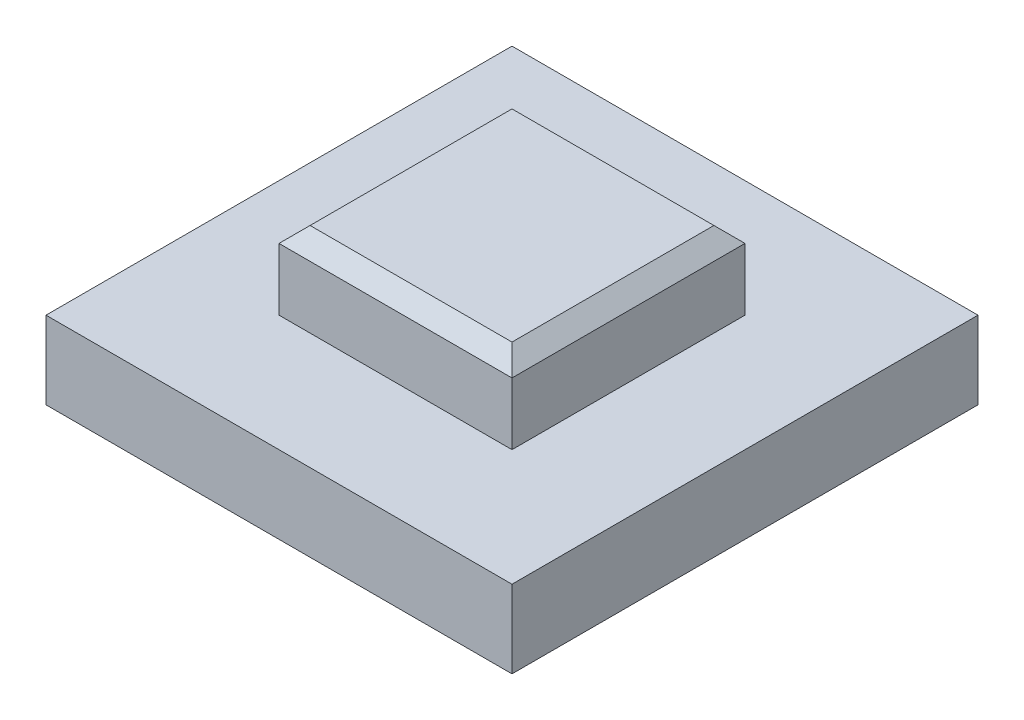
ISO-10303-21;
HEADER;
FILE_DESCRIPTION(('STEP AP214'),'2;1');
FILE_NAME('part.step','',(''),(''),'','','');
FILE_SCHEMA(('AUTOMOTIVE_DESIGN { 1 0 10303 214 1 1 1 1 }'));
ENDSEC;
DATA;
#1=APPLICATION_CONTEXT('core data for automotive mechanical design processes');
#2=APPLICATION_PROTOCOL_DEFINITION('international standard','automotive_design',2000,#1);
#3=PRODUCT_CONTEXT('',#1,'mechanical');
#4=PRODUCT('Part','Part','',(#3));
#5=PRODUCT_RELATED_PRODUCT_CATEGORY('part','',(#4));
#6=PRODUCT_DEFINITION_FORMATION('','',#4);
#7=PRODUCT_DEFINITION_CONTEXT('part definition',#1,'design');
#8=PRODUCT_DEFINITION('design','',#6,#7);
#9=PRODUCT_DEFINITION_SHAPE('','',#8);
#10=(LENGTH_UNIT() NAMED_UNIT(*) SI_UNIT(.MILLI.,.METRE.));
#11=(NAMED_UNIT(*) PLANE_ANGLE_UNIT() SI_UNIT($,.RADIAN.));
#12=(NAMED_UNIT(*) SI_UNIT($,.STERADIAN.) SOLID_ANGLE_UNIT());
#13=UNCERTAINTY_MEASURE_WITH_UNIT(LENGTH_MEASURE(1.E-05),#10,'distance_accuracy_value','');
#14=(GEOMETRIC_REPRESENTATION_CONTEXT(3) GLOBAL_UNCERTAINTY_ASSIGNED_CONTEXT((#13)) GLOBAL_UNIT_ASSIGNED_CONTEXT((#10,
#11,#12)) REPRESENTATION_CONTEXT('',''));
#15=CARTESIAN_POINT('',(0.,0.,0.));
#16=DIRECTION('',(0.,0.,1.));
#17=DIRECTION('',(1.,0.,0.));
#18=AXIS2_PLACEMENT_3D('',#15,#16,#17);
#19=CARTESIAN_POINT('',(-38.1,12.7,38.1));
#20=DIRECTION('',(0.,1.,0.));
#21=DIRECTION('',(0.,0.,1.));
#22=AXIS2_PLACEMENT_3D('',#19,#20,#21);
#23=PLANE('',#22);
#24=DIRECTION('',(0.,0.,1.));
#25=VECTOR('',#24,1.);
#26=CARTESIAN_POINT('',(-38.1,12.7,-38.1));
#27=LINE('',#26,#25);
#28=CARTESIAN_POINT('',(-38.1,12.7,-38.1));
#29=VERTEX_POINT('',#28);
#30=CARTESIAN_POINT('',(-38.1,12.7,38.1));
#31=VERTEX_POINT('',#30);
#32=EDGE_CURVE('E146',#29,#31,#27,.T.);
#33=ORIENTED_EDGE('',*,*,#32,.T.);
#34=DIRECTION('',(1.,0.,0.));
#35=VECTOR('',#34,1.);
#36=CARTESIAN_POINT('',(-38.1,12.7,38.1));
#37=LINE('',#36,#35);
#38=CARTESIAN_POINT('',(38.1,12.7,38.1));
#39=VERTEX_POINT('',#38);
#40=EDGE_CURVE('E149',#31,#39,#37,.T.);
#41=ORIENTED_EDGE('',*,*,#40,.T.);
#42=DIRECTION('',(0.,0.,-1.));
#43=VECTOR('',#42,1.);
#44=CARTESIAN_POINT('',(38.1,12.7,-38.1));
#45=LINE('',#44,#43);
#46=CARTESIAN_POINT('',(38.1,12.7,-38.1));
#47=VERTEX_POINT('',#46);
#48=EDGE_CURVE('E151',#39,#47,#45,.T.);
#49=ORIENTED_EDGE('',*,*,#48,.T.);
#50=DIRECTION('',(-1.,0.,0.));
#51=VECTOR('',#50,1.);
#52=CARTESIAN_POINT('',(-38.1,12.7,-38.1));
#53=LINE('',#52,#51);
#54=EDGE_CURVE('E153',#47,#29,#53,.T.);
#55=ORIENTED_EDGE('',*,*,#54,.T.);
#56=EDGE_LOOP('',(#33,#41,#49,#55));
#57=FACE_BOUND('',#56,.T.);
#58=DIRECTION('',(-1.,0.,0.));
#59=VECTOR('',#58,1.);
#60=CARTESIAN_POINT('',(19.05,12.7,-19.05));
#61=LINE('',#60,#59);
#62=CARTESIAN_POINT('',(19.05,12.7,-19.05));
#63=VERTEX_POINT('',#62);
#64=CARTESIAN_POINT('',(-19.05,12.7,-19.05));
#65=VERTEX_POINT('',#64);
#66=EDGE_CURVE('E109',#63,#65,#61,.T.);
#67=ORIENTED_EDGE('',*,*,#66,.F.);
#68=DIRECTION('',(0.,0.,-1.));
#69=VECTOR('',#68,1.);
#70=CARTESIAN_POINT('',(19.05,12.7,-19.05));
#71=LINE('',#70,#69);
#72=CARTESIAN_POINT('',(19.05,12.7,19.05));
#73=VERTEX_POINT('',#72);
#74=EDGE_CURVE('E117',#73,#63,#71,.T.);
#75=ORIENTED_EDGE('',*,*,#74,.F.);
#76=DIRECTION('',(1.,0.,0.));
#77=VECTOR('',#76,1.);
#78=CARTESIAN_POINT('',(19.05,12.7,19.05));
#79=LINE('',#78,#77);
#80=CARTESIAN_POINT('',(-19.05,12.7,19.05));
#81=VERTEX_POINT('',#80);
#82=EDGE_CURVE('E129',#81,#73,#79,.T.);
#83=ORIENTED_EDGE('',*,*,#82,.F.);
#84=DIRECTION('',(0.,0.,1.));
#85=VECTOR('',#84,1.);
#86=CARTESIAN_POINT('',(-19.05,12.7,-19.05));
#87=LINE('',#86,#85);
#88=EDGE_CURVE('E127',#65,#81,#87,.T.);
#89=ORIENTED_EDGE('',*,*,#88,.F.);
#90=EDGE_LOOP('',(#67,#75,#83,#89));
#91=FACE_BOUND('',#90,.T.);
#92=ADVANCED_FACE('F31',(#57,#91),#23,.T.);
#93=CARTESIAN_POINT('',(-38.1,12.7,-38.1));
#94=DIRECTION('',(1.,0.,0.));
#95=DIRECTION('',(0.,0.,-1.));
#96=AXIS2_PLACEMENT_3D('',#93,#94,#95);
#97=PLANE('',#96);
#98=DIRECTION('',(0.,0.,1.));
#99=VECTOR('',#98,1.);
#100=CARTESIAN_POINT('',(-38.1,0.,-38.1));
#101=LINE('',#100,#99);
#102=CARTESIAN_POINT('',(-38.1,0.,-38.1));
#103=VERTEX_POINT('',#102);
#104=CARTESIAN_POINT('',(-38.1,0.,38.1));
#105=VERTEX_POINT('',#104);
#106=EDGE_CURVE('E113',#103,#105,#101,.T.);
#107=ORIENTED_EDGE('',*,*,#106,.T.);
#108=DIRECTION('',(0.,-1.,0.));
#109=VECTOR('',#108,1.);
#110=CARTESIAN_POINT('',(-38.1,12.7,38.1));
#111=LINE('',#110,#109);
#112=EDGE_CURVE('E164',#31,#105,#111,.T.);
#113=ORIENTED_EDGE('',*,*,#112,.F.);
#114=ORIENTED_EDGE('',*,*,#32,.F.);
#115=DIRECTION('',(0.,-1.,0.));
#116=VECTOR('',#115,1.);
#117=CARTESIAN_POINT('',(-38.1,12.7,-38.1));
#118=LINE('',#117,#116);
#119=EDGE_CURVE('E155',#29,#103,#118,.T.);
#120=ORIENTED_EDGE('',*,*,#119,.T.);
#121=EDGE_LOOP('',(#107,#113,#114,#120));
#122=FACE_BOUND('',#121,.T.);
#123=ADVANCED_FACE('F33',(#122),#97,.F.);
#124=CARTESIAN_POINT('',(-38.1,12.7,38.1));
#125=DIRECTION('',(0.,0.,-1.));
#126=DIRECTION('',(-1.,0.,0.));
#127=AXIS2_PLACEMENT_3D('',#124,#125,#126);
#128=PLANE('',#127);
#129=DIRECTION('',(1.,0.,0.));
#130=VECTOR('',#129,1.);
#131=CARTESIAN_POINT('',(-38.1,0.,38.1));
#132=LINE('',#131,#130);
#133=CARTESIAN_POINT('',(38.1,0.,38.1));
#134=VERTEX_POINT('',#133);
#135=EDGE_CURVE('E140',#105,#134,#132,.T.);
#136=ORIENTED_EDGE('',*,*,#135,.T.);
#137=DIRECTION('',(0.,-1.,0.));
#138=VECTOR('',#137,1.);
#139=CARTESIAN_POINT('',(38.1,12.7,38.1));
#140=LINE('',#139,#138);
#141=EDGE_CURVE('E161',#39,#134,#140,.T.);
#142=ORIENTED_EDGE('',*,*,#141,.F.);
#143=ORIENTED_EDGE('',*,*,#40,.F.);
#144=ORIENTED_EDGE('',*,*,#112,.T.);
#145=EDGE_LOOP('',(#136,#142,#143,#144));
#146=FACE_BOUND('',#145,.T.);
#147=ADVANCED_FACE('F225',(#146),#128,.F.);
#148=CARTESIAN_POINT('',(38.1,12.7,-38.1));
#149=DIRECTION('',(-1.,0.,0.));
#150=DIRECTION('',(0.,0.,1.));
#151=AXIS2_PLACEMENT_3D('',#148,#149,#150);
#152=PLANE('',#151);
#153=DIRECTION('',(0.,0.,-1.));
#154=VECTOR('',#153,1.);
#155=CARTESIAN_POINT('',(38.1,0.,-38.1));
#156=LINE('',#155,#154);
#157=CARTESIAN_POINT('',(38.1,0.,-38.1));
#158=VERTEX_POINT('',#157);
#159=EDGE_CURVE('E142',#134,#158,#156,.T.);
#160=ORIENTED_EDGE('',*,*,#159,.T.);
#161=DIRECTION('',(0.,-1.,0.));
#162=VECTOR('',#161,1.);
#163=CARTESIAN_POINT('',(38.1,12.7,-38.1));
#164=LINE('',#163,#162);
#165=EDGE_CURVE('E158',#47,#158,#164,.T.);
#166=ORIENTED_EDGE('',*,*,#165,.F.);
#167=ORIENTED_EDGE('',*,*,#48,.F.);
#168=ORIENTED_EDGE('',*,*,#141,.T.);
#169=EDGE_LOOP('',(#160,#166,#167,#168));
#170=FACE_BOUND('',#169,.T.);
#171=ADVANCED_FACE('F234',(#170),#152,.F.);
#172=CARTESIAN_POINT('',(-38.1,12.7,-38.1));
#173=DIRECTION('',(0.,0.,1.));
#174=DIRECTION('',(1.,0.,0.));
#175=AXIS2_PLACEMENT_3D('',#172,#173,#174);
#176=PLANE('',#175);
#177=DIRECTION('',(-1.,0.,0.));
#178=VECTOR('',#177,1.);
#179=CARTESIAN_POINT('',(-38.1,0.,-38.1));
#180=LINE('',#179,#178);
#181=EDGE_CURVE('E144',#158,#103,#180,.T.);
#182=ORIENTED_EDGE('',*,*,#181,.T.);
#183=ORIENTED_EDGE('',*,*,#119,.F.);
#184=ORIENTED_EDGE('',*,*,#54,.F.);
#185=ORIENTED_EDGE('',*,*,#165,.T.);
#186=EDGE_LOOP('',(#182,#183,#184,#185));
#187=FACE_BOUND('',#186,.T.);
#188=ADVANCED_FACE('F231',(#187),#176,.F.);
#189=CARTESIAN_POINT('',(-38.1,0.,38.1));
#190=DIRECTION('',(0.,1.,0.));
#191=DIRECTION('',(0.,0.,1.));
#192=AXIS2_PLACEMENT_3D('',#189,#190,#191);
#193=PLANE('',#192);
#194=ORIENTED_EDGE('',*,*,#106,.F.);
#195=ORIENTED_EDGE('',*,*,#181,.F.);
#196=ORIENTED_EDGE('',*,*,#159,.F.);
#197=ORIENTED_EDGE('',*,*,#135,.F.);
#198=EDGE_LOOP('',(#194,#195,#196,#197));
#199=FACE_BOUND('',#198,.T.);
#200=ADVANCED_FACE('F229',(#199),#193,.F.);
#201=CARTESIAN_POINT('',(19.05,25.4,-19.05));
#202=DIRECTION('',(-1.,0.,0.));
#203=DIRECTION('',(0.,0.,1.));
#204=AXIS2_PLACEMENT_3D('',#201,#202,#203);
#205=PLANE('',#204);
#206=DIRECTION('',(0.,-1.,0.));
#207=VECTOR('',#206,1.);
#208=CARTESIAN_POINT('',(19.05,25.4,-19.05));
#209=LINE('',#208,#207);
#210=CARTESIAN_POINT('',(19.05,22.86,-19.05));
#211=VERTEX_POINT('',#210);
#212=EDGE_CURVE('E105',#211,#63,#209,.T.);
#213=ORIENTED_EDGE('',*,*,#212,.F.);
#214=DIRECTION('',(0.,0.,1.));
#215=VECTOR('',#214,1.);
#216=CARTESIAN_POINT('',(19.05,22.86,-19.05));
#217=LINE('',#216,#215);
#218=CARTESIAN_POINT('',(19.05,22.86,19.05));
#219=VERTEX_POINT('',#218);
#220=EDGE_CURVE('E11',#211,#219,#217,.T.);
#221=ORIENTED_EDGE('',*,*,#220,.T.);
#222=DIRECTION('',(0.,-1.,0.));
#223=VECTOR('',#222,1.);
#224=CARTESIAN_POINT('',(19.05,25.4,19.05));
#225=LINE('',#224,#223);
#226=EDGE_CURVE('E120',#219,#73,#225,.T.);
#227=ORIENTED_EDGE('',*,*,#226,.T.);
#228=ORIENTED_EDGE('',*,*,#74,.T.);
#229=EDGE_LOOP('',(#213,#221,#227,#228));
#230=FACE_BOUND('',#229,.T.);
#231=ADVANCED_FACE('F118',(#230),#205,.F.);
#232=CARTESIAN_POINT('',(19.05,25.4,-19.05));
#233=DIRECTION('',(0.,0.,1.));
#234=DIRECTION('',(1.,0.,0.));
#235=AXIS2_PLACEMENT_3D('',#232,#233,#234);
#236=PLANE('',#235);
#237=DIRECTION('',(0.,-1.,0.));
#238=VECTOR('',#237,1.);
#239=CARTESIAN_POINT('',(-19.05,25.4,-19.05));
#240=LINE('',#239,#238);
#241=CARTESIAN_POINT('',(-19.05,22.86,-19.05));
#242=VERTEX_POINT('',#241);
#243=EDGE_CURVE('E114',#242,#65,#240,.T.);
#244=ORIENTED_EDGE('',*,*,#243,.F.);
#245=DIRECTION('',(1.,0.,0.));
#246=VECTOR('',#245,1.);
#247=CARTESIAN_POINT('',(19.05,22.86,-19.05));
#248=LINE('',#247,#246);
#249=EDGE_CURVE('E39',#242,#211,#248,.T.);
#250=ORIENTED_EDGE('',*,*,#249,.T.);
#251=ORIENTED_EDGE('',*,*,#212,.T.);
#252=ORIENTED_EDGE('',*,*,#66,.T.);
#253=EDGE_LOOP('',(#244,#250,#251,#252));
#254=FACE_BOUND('',#253,.T.);
#255=ADVANCED_FACE('F107',(#254),#236,.F.);
#256=CARTESIAN_POINT('',(-19.05,25.4,-19.05));
#257=DIRECTION('',(1.,0.,0.));
#258=DIRECTION('',(0.,0.,-1.));
#259=AXIS2_PLACEMENT_3D('',#256,#257,#258);
#260=PLANE('',#259);
#261=DIRECTION('',(0.,-1.,0.));
#262=VECTOR('',#261,1.);
#263=CARTESIAN_POINT('',(-19.05,25.4,19.05));
#264=LINE('',#263,#262);
#265=CARTESIAN_POINT('',(-19.05,22.86,19.05));
#266=VERTEX_POINT('',#265);
#267=EDGE_CURVE('E135',#266,#81,#264,.T.);
#268=ORIENTED_EDGE('',*,*,#267,.F.);
#269=DIRECTION('',(0.,0.,-1.));
#270=VECTOR('',#269,1.);
#271=CARTESIAN_POINT('',(-19.05,22.86,-19.05));
#272=LINE('',#271,#270);
#273=EDGE_CURVE('E53',#266,#242,#272,.T.);
#274=ORIENTED_EDGE('',*,*,#273,.T.);
#275=ORIENTED_EDGE('',*,*,#243,.T.);
#276=ORIENTED_EDGE('',*,*,#88,.T.);
#277=EDGE_LOOP('',(#268,#274,#275,#276));
#278=FACE_BOUND('',#277,.T.);
#279=ADVANCED_FACE('F184',(#278),#260,.F.);
#280=CARTESIAN_POINT('',(19.05,25.4,19.05));
#281=DIRECTION('',(0.,0.,-1.));
#282=DIRECTION('',(-1.,0.,0.));
#283=AXIS2_PLACEMENT_3D('',#280,#281,#282);
#284=PLANE('',#283);
#285=ORIENTED_EDGE('',*,*,#226,.F.);
#286=DIRECTION('',(-1.,0.,0.));
#287=VECTOR('',#286,1.);
#288=CARTESIAN_POINT('',(19.05,22.86,19.05));
#289=LINE('',#288,#287);
#290=EDGE_CURVE('E176',#219,#266,#289,.T.);
#291=ORIENTED_EDGE('',*,*,#290,.T.);
#292=ORIENTED_EDGE('',*,*,#267,.T.);
#293=ORIENTED_EDGE('',*,*,#82,.T.);
#294=EDGE_LOOP('',(#285,#291,#292,#293));
#295=FACE_BOUND('',#294,.T.);
#296=ADVANCED_FACE('F181',(#295),#284,.F.);
#297=CARTESIAN_POINT('',(19.05,25.4,19.05));
#298=DIRECTION('',(0.,-1.,0.));
#299=DIRECTION('',(0.,0.,-1.));
#300=AXIS2_PLACEMENT_3D('',#297,#298,#299);
#301=PLANE('',#300);
#302=DIRECTION('',(0.,0.,1.));
#303=VECTOR('',#302,1.);
#304=CARTESIAN_POINT('',(-16.51,25.4,19.05));
#305=LINE('',#304,#303);
#306=CARTESIAN_POINT('',(-16.51,25.4,-16.51));
#307=VERTEX_POINT('',#306);
#308=CARTESIAN_POINT('',(-16.51,25.4,16.51));
#309=VERTEX_POINT('',#308);
#310=EDGE_CURVE('E171',#307,#309,#305,.T.);
#311=ORIENTED_EDGE('',*,*,#310,.T.);
#312=DIRECTION('',(1.,0.,0.));
#313=VECTOR('',#312,1.);
#314=CARTESIAN_POINT('',(19.05,25.4,16.51));
#315=LINE('',#314,#313);
#316=CARTESIAN_POINT('',(16.51,25.4,16.51));
#317=VERTEX_POINT('',#316);
#318=EDGE_CURVE('E173',#309,#317,#315,.T.);
#319=ORIENTED_EDGE('',*,*,#318,.T.);
#320=DIRECTION('',(0.,0.,-1.));
#321=VECTOR('',#320,1.);
#322=CARTESIAN_POINT('',(16.51,25.4,19.05));
#323=LINE('',#322,#321);
#324=CARTESIAN_POINT('',(16.51,25.4,-16.51));
#325=VERTEX_POINT('',#324);
#326=EDGE_CURVE('E167',#317,#325,#323,.T.);
#327=ORIENTED_EDGE('',*,*,#326,.T.);
#328=DIRECTION('',(-1.,0.,0.));
#329=VECTOR('',#328,1.);
#330=CARTESIAN_POINT('',(19.05,25.4,-16.51));
#331=LINE('',#330,#329);
#332=EDGE_CURVE('E169',#325,#307,#331,.T.);
#333=ORIENTED_EDGE('',*,*,#332,.T.);
#334=EDGE_LOOP('',(#311,#319,#327,#333));
#335=FACE_BOUND('',#334,.T.);
#336=ADVANCED_FACE('F208',(#335),#301,.F.);
#337=CARTESIAN_POINT('',(19.05,25.4,-16.51));
#338=DIRECTION('',(0.,-0.707106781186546,0.70710678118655));
#339=DIRECTION('',(0.,-0.70710678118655,-0.707106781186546));
#340=AXIS2_PLACEMENT_3D('',#337,#338,#339);
#341=PLANE('',#340);
#342=DIRECTION('',(-0.577350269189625,0.577350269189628,0.577350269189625));
#343=VECTOR('',#342,1.);
#344=CARTESIAN_POINT('',(4.65666666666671,37.2533333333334,-4.65666666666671));
#345=LINE('',#344,#343);
#346=EDGE_CURVE('E192',#211,#325,#345,.T.);
#347=ORIENTED_EDGE('',*,*,#346,.F.);
#348=ORIENTED_EDGE('',*,*,#249,.F.);
#349=DIRECTION('',(0.577350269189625,0.577350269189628,0.577350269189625));
#350=VECTOR('',#349,1.);
#351=CARTESIAN_POINT('',(-4.65666666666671,37.2533333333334,-4.65666666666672));
#352=LINE('',#351,#350);
#353=EDGE_CURVE('E124',#307,#242,#352,.F.);
#354=ORIENTED_EDGE('',*,*,#353,.F.);
#355=ORIENTED_EDGE('',*,*,#332,.F.);
#356=EDGE_LOOP('',(#347,#348,#354,#355));
#357=FACE_BOUND('',#356,.T.);
#358=ADVANCED_FACE('F188',(#357),#341,.F.);
#359=CARTESIAN_POINT('',(-16.51,25.4,19.05));
#360=DIRECTION('',(0.70710678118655,-0.707106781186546,0.));
#361=DIRECTION('',(0.707106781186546,0.70710678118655,0.));
#362=AXIS2_PLACEMENT_3D('',#359,#360,#361);
#363=PLANE('',#362);
#364=ORIENTED_EDGE('',*,*,#353,.T.);
#365=ORIENTED_EDGE('',*,*,#273,.F.);
#366=DIRECTION('',(0.577350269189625,0.577350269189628,-0.577350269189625));
#367=VECTOR('',#366,1.);
#368=CARTESIAN_POINT('',(-17.3566666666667,24.5533333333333,17.3566666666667));
#369=LINE('',#368,#367);
#370=EDGE_CURVE('E197',#309,#266,#369,.F.);
#371=ORIENTED_EDGE('',*,*,#370,.F.);
#372=ORIENTED_EDGE('',*,*,#310,.F.);
#373=EDGE_LOOP('',(#364,#365,#371,#372));
#374=FACE_BOUND('',#373,.T.);
#375=ADVANCED_FACE('F195',(#374),#363,.F.);
#376=CARTESIAN_POINT('',(16.51,25.4,19.05));
#377=DIRECTION('',(-0.70710678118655,-0.707106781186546,0.));
#378=DIRECTION('',(0.707106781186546,-0.70710678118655,0.));
#379=AXIS2_PLACEMENT_3D('',#376,#377,#378);
#380=PLANE('',#379);
#381=ORIENTED_EDGE('',*,*,#346,.T.);
#382=ORIENTED_EDGE('',*,*,#326,.F.);
#383=DIRECTION('',(0.577350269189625,-0.577350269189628,0.577350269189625));
#384=VECTOR('',#383,1.);
#385=CARTESIAN_POINT('',(17.3566666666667,24.5533333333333,17.3566666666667));
#386=LINE('',#385,#384);
#387=EDGE_CURVE('E201',#219,#317,#386,.F.);
#388=ORIENTED_EDGE('',*,*,#387,.F.);
#389=ORIENTED_EDGE('',*,*,#220,.F.);
#390=EDGE_LOOP('',(#381,#382,#388,#389));
#391=FACE_BOUND('',#390,.T.);
#392=ADVANCED_FACE('F206',(#391),#380,.F.);
#393=CARTESIAN_POINT('',(19.05,25.4,16.51));
#394=DIRECTION('',(0.,-0.707106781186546,-0.70710678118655));
#395=DIRECTION('',(0.,0.70710678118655,-0.707106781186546));
#396=AXIS2_PLACEMENT_3D('',#393,#394,#395);
#397=PLANE('',#396);
#398=ORIENTED_EDGE('',*,*,#370,.T.);
#399=ORIENTED_EDGE('',*,*,#290,.F.);
#400=ORIENTED_EDGE('',*,*,#387,.T.);
#401=ORIENTED_EDGE('',*,*,#318,.F.);
#402=EDGE_LOOP('',(#398,#399,#400,#401));
#403=FACE_BOUND('',#402,.T.);
#404=ADVANCED_FACE('F204',(#403),#397,.F.);
#405=CLOSED_SHELL('',(#92,#123,#147,#171,#188,#200,#231,#255,#279,#296,#336,#358,#375,#392,#404));
#406=MANIFOLD_SOLID_BREP('B2',#405);
#407=ADVANCED_BREP_SHAPE_REPRESENTATION('',(#18,#406),#14);
#408=SHAPE_DEFINITION_REPRESENTATION(#9,#407);
ENDSEC;
END-ISO-10303-21;
